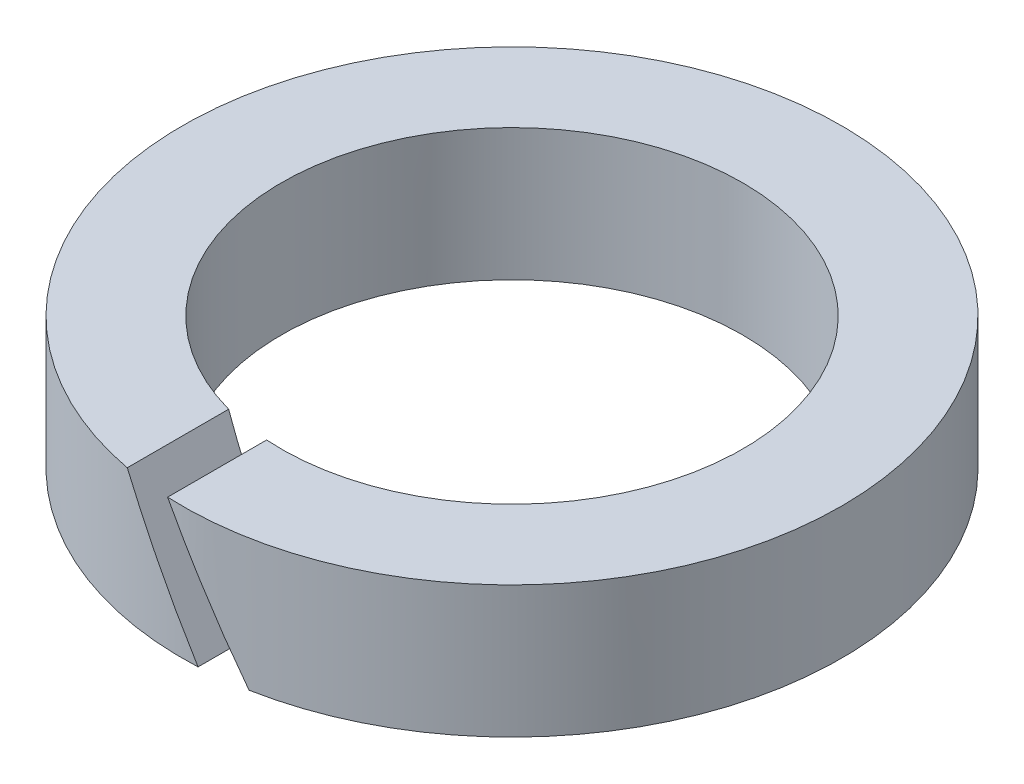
ISO-10303-21;
HEADER;
FILE_DESCRIPTION(('STEP AP214'),'2;1');
FILE_NAME('part.step','',(''),(''),'','','');
FILE_SCHEMA(('AUTOMOTIVE_DESIGN { 1 0 10303 214 1 1 1 1 }'));
ENDSEC;
DATA;
#1=APPLICATION_CONTEXT('core data for automotive mechanical design processes');
#2=APPLICATION_PROTOCOL_DEFINITION('international standard','automotive_design',2000,#1);
#3=PRODUCT_CONTEXT('',#1,'mechanical');
#4=PRODUCT('Part','Part','',(#3));
#5=PRODUCT_RELATED_PRODUCT_CATEGORY('part','',(#4));
#6=PRODUCT_DEFINITION_FORMATION('','',#4);
#7=PRODUCT_DEFINITION_CONTEXT('part definition',#1,'design');
#8=PRODUCT_DEFINITION('design','',#6,#7);
#9=PRODUCT_DEFINITION_SHAPE('','',#8);
#10=(LENGTH_UNIT() NAMED_UNIT(*) SI_UNIT(.MILLI.,.METRE.));
#11=(NAMED_UNIT(*) PLANE_ANGLE_UNIT() SI_UNIT($,.RADIAN.));
#12=(NAMED_UNIT(*) SI_UNIT($,.STERADIAN.) SOLID_ANGLE_UNIT());
#13=UNCERTAINTY_MEASURE_WITH_UNIT(LENGTH_MEASURE(1.E-05),#10,'distance_accuracy_value','');
#14=(GEOMETRIC_REPRESENTATION_CONTEXT(3) GLOBAL_UNCERTAINTY_ASSIGNED_CONTEXT((#13)) GLOBAL_UNIT_ASSIGNED_CONTEXT((#10,
#11,#12)) REPRESENTATION_CONTEXT('',''));
#15=CARTESIAN_POINT('',(0.,0.,0.));
#16=DIRECTION('',(0.,0.,1.));
#17=DIRECTION('',(1.,0.,0.));
#18=AXIS2_PLACEMENT_3D('',#15,#16,#17);
#19=CARTESIAN_POINT('',(-4.44089209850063E-12,79.9999999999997,-4.88498130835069E-12));
#20=DIRECTION('',(0.,0.999999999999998,0.));
#21=DIRECTION('',(1.08968389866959E-13,0.,0.999999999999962));
#22=AXIS2_PLACEMENT_3D('',#19,#20,#21);
#23=CYLINDRICAL_SURFACE('',#22,3.50000000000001);
#24=CARTESIAN_POINT('',(0.,0.600000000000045,0.));
#25=DIRECTION('',(-0.86602540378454,-0.5,0.));
#26=DIRECTION('',(-0.500000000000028,0.866025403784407,0.));
#27=AXIS2_PLACEMENT_3D('',#24,#25,#26);
#28=ELLIPSE('',#27,7.00000000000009,3.50000000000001);
#29=CARTESIAN_POINT('',(0.923760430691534,-1.,3.37589494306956));
#30=VERTEX_POINT('',#29);
#31=CARTESIAN_POINT('',(-0.230940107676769,0.99999999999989,3.49237264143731));
#32=VERTEX_POINT('',#31);
#33=EDGE_CURVE('E52',#30,#32,#28,.T.);
#34=ORIENTED_EDGE('',*,*,#33,.T.);
#35=CARTESIAN_POINT('',(0.,1.,0.));
#36=DIRECTION('',(0.,0.999999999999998,0.));
#37=DIRECTION('',(1.08968389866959E-13,0.,0.999999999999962));
#38=AXIS2_PLACEMENT_3D('',#35,#36,#37);
#39=CIRCLE('',#38,3.50000000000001);
#40=CARTESIAN_POINT('',(-0.923760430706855,0.99999999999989,3.37589494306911));
#41=VERTEX_POINT('',#40);
#42=EDGE_CURVE('E11',#32,#41,#39,.T.);
#43=ORIENTED_EDGE('',*,*,#42,.T.);
#44=CARTESIAN_POINT('',(0.,-0.600000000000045,0.));
#45=DIRECTION('',(-0.86602540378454,-0.5,0.));
#46=DIRECTION('',(-0.500000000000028,0.866025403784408,0.));
#47=AXIS2_PLACEMENT_3D('',#44,#45,#46);
#48=ELLIPSE('',#47,7.00000000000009,3.50000000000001);
#49=CARTESIAN_POINT('',(0.230940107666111,-1.00000000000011,3.49237264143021));
#50=VERTEX_POINT('',#49);
#51=EDGE_CURVE('E68',#50,#41,#48,.T.);
#52=ORIENTED_EDGE('',*,*,#51,.F.);
#53=CARTESIAN_POINT('',(0.,-1.,0.));
#54=DIRECTION('',(0.,0.999999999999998,0.));
#55=DIRECTION('',(1.08968389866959E-13,0.,0.999999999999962));
#56=AXIS2_PLACEMENT_3D('',#53,#54,#55);
#57=CIRCLE('',#56,3.50000000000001);
#58=EDGE_CURVE('E76',#30,#50,#57,.T.);
#59=ORIENTED_EDGE('',*,*,#58,.F.);
#60=EDGE_LOOP('',(#34,#43,#52,#59));
#61=FACE_BOUND('',#60,.T.);
#62=ADVANCED_FACE('F30',(#61),#23,.F.);
#63=CARTESIAN_POINT('',(3.49999999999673,0.99999999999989,8.88178419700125E-13));
#64=DIRECTION('',(0.,0.999999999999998,0.));
#65=DIRECTION('',(1.08968389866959E-13,0.,0.999999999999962));
#66=AXIS2_PLACEMENT_3D('',#63,#64,#65);
#67=PLANE('',#66);
#68=ORIENTED_EDGE('',*,*,#42,.F.);
#69=DIRECTION('',(-1.08968389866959E-13,0.,-0.999999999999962));
#70=VECTOR('',#69,1.);
#71=CARTESIAN_POINT('',(-0.230940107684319,1.,5.00099999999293));
#72=LINE('',#71,#70);
#73=CARTESIAN_POINT('',(-0.230940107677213,1.,4.99466381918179));
#74=VERTEX_POINT('',#73);
#75=EDGE_CURVE('E84',#74,#32,#72,.T.);
#76=ORIENTED_EDGE('',*,*,#75,.F.);
#77=CARTESIAN_POINT('',(0.,1.,0.));
#78=DIRECTION('',(0.,0.999999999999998,0.));
#79=DIRECTION('',(1.08968389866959E-13,0.,0.999999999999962));
#80=AXIS2_PLACEMENT_3D('',#77,#78,#79);
#81=CIRCLE('',#80,5.00000000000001);
#82=CARTESIAN_POINT('',(-0.923760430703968,0.99999999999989,4.91392578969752));
#83=VERTEX_POINT('',#82);
#84=EDGE_CURVE('E37',#74,#83,#81,.T.);
#85=ORIENTED_EDGE('',*,*,#84,.T.);
#86=DIRECTION('',(-1.08968389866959E-13,0.,-0.999999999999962));
#87=VECTOR('',#86,1.);
#88=CARTESIAN_POINT('',(-0.92376043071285,0.99999999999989,5.00100000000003));
#89=LINE('',#88,#87);
#90=EDGE_CURVE('E71',#83,#41,#89,.T.);
#91=ORIENTED_EDGE('',*,*,#90,.T.);
#92=EDGE_LOOP('',(#68,#76,#85,#91));
#93=FACE_BOUND('',#92,.T.);
#94=ADVANCED_FACE('F81',(#93),#67,.T.);
#95=CARTESIAN_POINT('',(-4.44089209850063E-12,79.9999999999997,-4.88498130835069E-12));
#96=DIRECTION('',(0.,0.999999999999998,0.));
#97=DIRECTION('',(1.08968389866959E-13,0.,0.999999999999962));
#98=AXIS2_PLACEMENT_3D('',#95,#96,#97);
#99=CYLINDRICAL_SURFACE('',#98,5.00000000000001);
#100=CARTESIAN_POINT('',(0.,0.600000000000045,0.));
#101=DIRECTION('',(-0.86602540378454,-0.5,0.));
#102=DIRECTION('',(-0.500000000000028,0.866025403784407,0.));
#103=AXIS2_PLACEMENT_3D('',#100,#101,#102);
#104=ELLIPSE('',#103,10.0000000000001,5.00000000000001);
#105=CARTESIAN_POINT('',(0.923760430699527,-1.,4.91392578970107));
#106=VERTEX_POINT('',#105);
#107=EDGE_CURVE('E86',#74,#106,#104,.F.);
#108=ORIENTED_EDGE('',*,*,#107,.T.);
#109=CARTESIAN_POINT('',(0.,-1.,0.));
#110=DIRECTION('',(0.,0.999999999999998,0.));
#111=DIRECTION('',(1.08968389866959E-13,0.,0.999999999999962));
#112=AXIS2_PLACEMENT_3D('',#109,#110,#111);
#113=CIRCLE('',#112,5.00000000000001);
#114=CARTESIAN_POINT('',(0.230940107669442,-1.,4.99466381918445));
#115=VERTEX_POINT('',#114);
#116=EDGE_CURVE('E97',#106,#115,#113,.T.);
#117=ORIENTED_EDGE('',*,*,#116,.T.);
#118=CARTESIAN_POINT('',(0.,-0.600000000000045,0.));
#119=DIRECTION('',(-0.86602540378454,-0.5,0.));
#120=DIRECTION('',(-0.500000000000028,0.866025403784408,0.));
#121=AXIS2_PLACEMENT_3D('',#118,#119,#120);
#122=ELLIPSE('',#121,10.0000000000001,5.00000000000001);
#123=EDGE_CURVE('E44',#83,#115,#122,.F.);
#124=ORIENTED_EDGE('',*,*,#123,.F.);
#125=ORIENTED_EDGE('',*,*,#84,.F.);
#126=EDGE_LOOP('',(#108,#117,#124,#125));
#127=FACE_BOUND('',#126,.T.);
#128=ADVANCED_FACE('F101',(#127),#99,.T.);
#129=CARTESIAN_POINT('',(4.99999999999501,-1.00000000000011,-2.66453525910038E-12));
#130=DIRECTION('',(0.,-0.999999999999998,0.));
#131=DIRECTION('',(-1.08968389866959E-13,0.,-0.999999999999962));
#132=AXIS2_PLACEMENT_3D('',#129,#130,#131);
#133=PLANE('',#132);
#134=ORIENTED_EDGE('',*,*,#116,.F.);
#135=DIRECTION('',(-1.08968389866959E-13,0.,-0.999999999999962));
#136=VECTOR('',#135,1.);
#137=CARTESIAN_POINT('',(0.923760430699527,-1.,5.00099999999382));
#138=LINE('',#137,#136);
#139=EDGE_CURVE('E93',#106,#30,#138,.T.);
#140=ORIENTED_EDGE('',*,*,#139,.T.);
#141=ORIENTED_EDGE('',*,*,#58,.T.);
#142=DIRECTION('',(-1.08968389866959E-13,0.,-0.999999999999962));
#143=VECTOR('',#142,1.);
#144=CARTESIAN_POINT('',(0.230940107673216,-1.,5.00100000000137));
#145=LINE('',#144,#143);
#146=EDGE_CURVE('E72',#115,#50,#145,.T.);
#147=ORIENTED_EDGE('',*,*,#146,.F.);
#148=EDGE_LOOP('',(#134,#140,#141,#147));
#149=FACE_BOUND('',#148,.T.);
#150=ADVANCED_FACE('F103',(#149),#133,.T.);
#151=CARTESIAN_POINT('',(0.230940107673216,-1.,5.00100000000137));
#152=DIRECTION('',(-0.86602540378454,-0.5,0.));
#153=DIRECTION('',(0.500000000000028,-0.866025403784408,0.));
#154=AXIS2_PLACEMENT_3D('',#151,#152,#153);
#155=PLANE('',#154);
#156=ORIENTED_EDGE('',*,*,#51,.T.);
#157=ORIENTED_EDGE('',*,*,#90,.F.);
#158=ORIENTED_EDGE('',*,*,#123,.T.);
#159=ORIENTED_EDGE('',*,*,#146,.T.);
#160=EDGE_LOOP('',(#156,#157,#158,#159));
#161=FACE_BOUND('',#160,.T.);
#162=ADVANCED_FACE('F70',(#161),#155,.F.);
#163=CARTESIAN_POINT('',(0.923760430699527,-1.,5.00099999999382));
#164=DIRECTION('',(-0.86602540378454,-0.5,0.));
#165=DIRECTION('',(0.500000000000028,-0.866025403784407,0.));
#166=AXIS2_PLACEMENT_3D('',#163,#164,#165);
#167=PLANE('',#166);
#168=ORIENTED_EDGE('',*,*,#139,.F.);
#169=ORIENTED_EDGE('',*,*,#107,.F.);
#170=ORIENTED_EDGE('',*,*,#75,.T.);
#171=ORIENTED_EDGE('',*,*,#33,.F.);
#172=EDGE_LOOP('',(#168,#169,#170,#171));
#173=FACE_BOUND('',#172,.T.);
#174=ADVANCED_FACE('F104',(#173),#167,.T.);
#175=CLOSED_SHELL('',(#62,#94,#128,#150,#162,#174));
#176=MANIFOLD_SOLID_BREP('B2',#175);
#177=ADVANCED_BREP_SHAPE_REPRESENTATION('',(#18,#176),#14);
#178=SHAPE_DEFINITION_REPRESENTATION(#9,#177);
ENDSEC;
END-ISO-10303-21;
